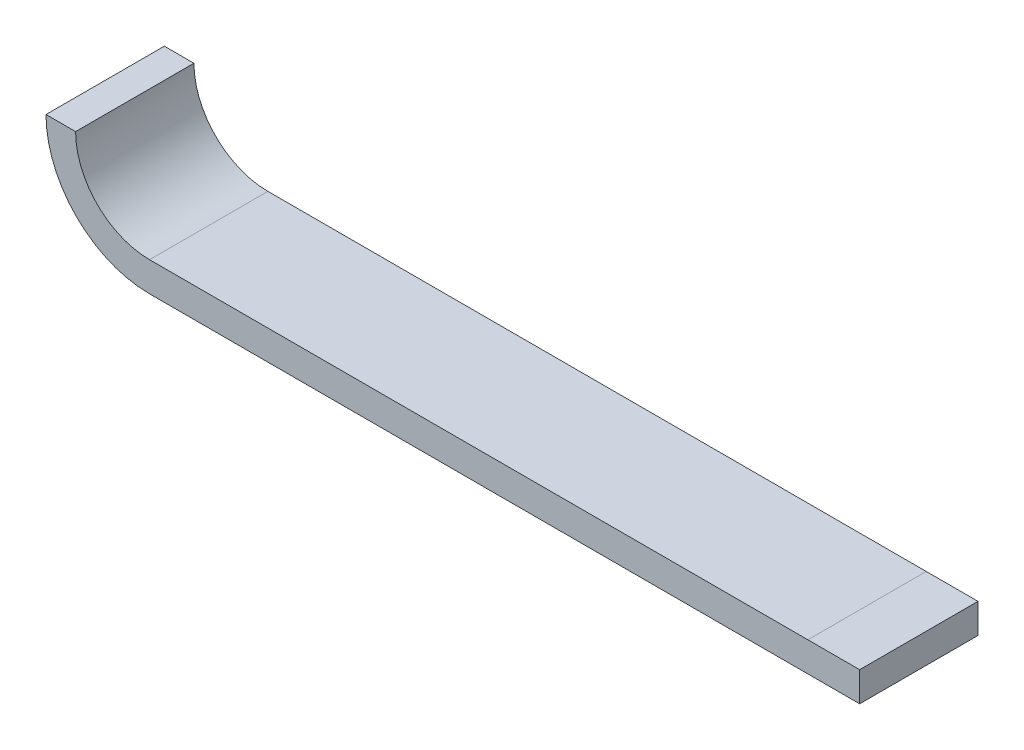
ISO-10303-21;
HEADER;
FILE_DESCRIPTION(('STEP AP214'),'2;1');
FILE_NAME('part.step','',(''),(''),'','','');
FILE_SCHEMA(('AUTOMOTIVE_DESIGN { 1 0 10303 214 1 1 1 1 }'));
ENDSEC;
DATA;
#1=APPLICATION_CONTEXT('core data for automotive mechanical design processes');
#2=APPLICATION_PROTOCOL_DEFINITION('international standard','automotive_design',2000,#1);
#3=PRODUCT_CONTEXT('',#1,'mechanical');
#4=PRODUCT('Part','Part','',(#3));
#5=PRODUCT_RELATED_PRODUCT_CATEGORY('part','',(#4));
#6=PRODUCT_DEFINITION_FORMATION('','',#4);
#7=PRODUCT_DEFINITION_CONTEXT('part definition',#1,'design');
#8=PRODUCT_DEFINITION('design','',#6,#7);
#9=PRODUCT_DEFINITION_SHAPE('','',#8);
#10=(LENGTH_UNIT() NAMED_UNIT(*) SI_UNIT(.MILLI.,.METRE.));
#11=(NAMED_UNIT(*) PLANE_ANGLE_UNIT() SI_UNIT($,.RADIAN.));
#12=(NAMED_UNIT(*) SI_UNIT($,.STERADIAN.) SOLID_ANGLE_UNIT());
#13=UNCERTAINTY_MEASURE_WITH_UNIT(LENGTH_MEASURE(1.E-05),#10,'distance_accuracy_value','');
#14=(GEOMETRIC_REPRESENTATION_CONTEXT(3) GLOBAL_UNCERTAINTY_ASSIGNED_CONTEXT((#13)) GLOBAL_UNIT_ASSIGNED_CONTEXT((#10,
#11,#12)) REPRESENTATION_CONTEXT('',''));
#15=CARTESIAN_POINT('',(0.,0.,0.));
#16=DIRECTION('',(0.,0.,1.));
#17=DIRECTION('',(1.,0.,0.));
#18=AXIS2_PLACEMENT_3D('',#15,#16,#17);
#19=CARTESIAN_POINT('',(0.,-31.75,25.4));
#20=DIRECTION('',(0.,1.,0.));
#21=DIRECTION('',(0.,0.,1.));
#22=AXIS2_PLACEMENT_3D('',#19,#20,#21);
#23=PLANE('',#22);
#24=DIRECTION('',(1.,0.,0.));
#25=VECTOR('',#24,1.);
#26=CARTESIAN_POINT('',(0.,-31.75,25.4));
#27=LINE('',#26,#25);
#28=CARTESIAN_POINT('',(0.,-31.75,25.4));
#29=VERTEX_POINT('',#28);
#30=CARTESIAN_POINT('',(282.575,-31.75,25.4));
#31=VERTEX_POINT('',#30);
#32=EDGE_CURVE('E134',#29,#31,#27,.T.);
#33=ORIENTED_EDGE('',*,*,#32,.T.);
#34=DIRECTION('',(0.,0.,-1.));
#35=VECTOR('',#34,1.);
#36=CARTESIAN_POINT('',(282.575,-31.75,25.4));
#37=LINE('',#36,#35);
#38=CARTESIAN_POINT('',(282.575,-31.75,-25.4));
#39=VERTEX_POINT('',#38);
#40=EDGE_CURVE('E11',#31,#39,#37,.T.);
#41=ORIENTED_EDGE('',*,*,#40,.T.);
#42=DIRECTION('',(1.,0.,0.));
#43=VECTOR('',#42,1.);
#44=CARTESIAN_POINT('',(0.,-31.75,-25.4));
#45=LINE('',#44,#43);
#46=CARTESIAN_POINT('',(0.,-31.75,-25.4));
#47=VERTEX_POINT('',#46);
#48=EDGE_CURVE('E162',#47,#39,#45,.T.);
#49=ORIENTED_EDGE('',*,*,#48,.F.);
#50=DIRECTION('',(0.,0.,1.));
#51=VECTOR('',#50,1.);
#52=CARTESIAN_POINT('',(0.,-31.75,25.4));
#53=LINE('',#52,#51);
#54=EDGE_CURVE('E120',#47,#29,#53,.T.);
#55=ORIENTED_EDGE('',*,*,#54,.T.);
#56=EDGE_LOOP('',(#33,#41,#49,#55));
#57=FACE_BOUND('',#56,.T.);
#58=ADVANCED_FACE('F36',(#57),#23,.T.);
#59=CARTESIAN_POINT('',(0.,-44.45,25.4));
#60=DIRECTION('',(0.,-1.,0.));
#61=DIRECTION('',(0.,0.,-1.));
#62=AXIS2_PLACEMENT_3D('',#59,#60,#61);
#63=PLANE('',#62);
#64=DIRECTION('',(1.,0.,0.));
#65=VECTOR('',#64,1.);
#66=CARTESIAN_POINT('',(0.,-44.45,-25.4));
#67=LINE('',#66,#65);
#68=CARTESIAN_POINT('',(0.,-44.45,-25.4));
#69=VERTEX_POINT('',#68);
#70=CARTESIAN_POINT('',(152.4,-44.45,-25.4));
#71=VERTEX_POINT('',#70);
#72=EDGE_CURVE('E128',#69,#71,#67,.T.);
#73=ORIENTED_EDGE('',*,*,#72,.T.);
#74=DIRECTION('',(0.,0.,1.));
#75=VECTOR('',#74,1.);
#76=CARTESIAN_POINT('',(152.4,-44.45,25.4));
#77=LINE('',#76,#75);
#78=CARTESIAN_POINT('',(152.4,-44.45,25.4));
#79=VERTEX_POINT('',#78);
#80=EDGE_CURVE('E45',#71,#79,#77,.T.);
#81=ORIENTED_EDGE('',*,*,#80,.T.);
#82=DIRECTION('',(1.,0.,0.));
#83=VECTOR('',#82,1.);
#84=CARTESIAN_POINT('',(0.,-44.45,25.4));
#85=LINE('',#84,#83);
#86=CARTESIAN_POINT('',(0.,-44.45,25.4));
#87=VERTEX_POINT('',#86);
#88=EDGE_CURVE('E104',#87,#79,#85,.T.);
#89=ORIENTED_EDGE('',*,*,#88,.F.);
#90=DIRECTION('',(0.,0.,-1.));
#91=VECTOR('',#90,1.);
#92=CARTESIAN_POINT('',(0.,-44.45,25.4));
#93=LINE('',#92,#91);
#94=EDGE_CURVE('E114',#87,#69,#93,.T.);
#95=ORIENTED_EDGE('',*,*,#94,.T.);
#96=EDGE_LOOP('',(#73,#81,#89,#95));
#97=FACE_BOUND('',#96,.T.);
#98=ADVANCED_FACE('F123',(#97),#63,.T.);
#99=CARTESIAN_POINT('',(0.,0.,0.));
#100=DIRECTION('',(0.,0.,-1.));
#101=DIRECTION('',(-1.,0.,0.));
#102=AXIS2_PLACEMENT_3D('',#99,#100,#101);
#103=CYLINDRICAL_SURFACE('',#102,31.75);
#104=ORIENTED_EDGE('',*,*,#54,.F.);
#105=CARTESIAN_POINT('',(0.,0.,-25.4));
#106=DIRECTION('',(0.,0.,-1.));
#107=DIRECTION('',(-1.,0.,0.));
#108=AXIS2_PLACEMENT_3D('',#105,#106,#107);
#109=CIRCLE('',#108,31.75);
#110=CARTESIAN_POINT('',(-31.75,0.,-25.4));
#111=VERTEX_POINT('',#110);
#112=EDGE_CURVE('E140',#47,#111,#109,.T.);
#113=ORIENTED_EDGE('',*,*,#112,.T.);
#114=DIRECTION('',(0.,0.,1.));
#115=VECTOR('',#114,1.);
#116=CARTESIAN_POINT('',(-31.75,0.,25.4));
#117=LINE('',#116,#115);
#118=CARTESIAN_POINT('',(-31.75,0.,25.4));
#119=VERTEX_POINT('',#118);
#120=EDGE_CURVE('E111',#111,#119,#117,.T.);
#121=ORIENTED_EDGE('',*,*,#120,.T.);
#122=CARTESIAN_POINT('',(0.,0.,25.4));
#123=DIRECTION('',(0.,0.,-1.));
#124=DIRECTION('',(-1.,0.,0.));
#125=AXIS2_PLACEMENT_3D('',#122,#123,#124);
#126=CIRCLE('',#125,31.75);
#127=EDGE_CURVE('E143',#29,#119,#126,.T.);
#128=ORIENTED_EDGE('',*,*,#127,.F.);
#129=EDGE_LOOP('',(#104,#113,#121,#128));
#130=FACE_BOUND('',#129,.T.);
#131=ADVANCED_FACE('F38',(#130),#103,.F.);
#132=CARTESIAN_POINT('',(0.,0.,0.));
#133=DIRECTION('',(0.,0.,-1.));
#134=DIRECTION('',(-1.,0.,0.));
#135=AXIS2_PLACEMENT_3D('',#132,#133,#134);
#136=CYLINDRICAL_SURFACE('',#135,44.45);
#137=ORIENTED_EDGE('',*,*,#94,.F.);
#138=CARTESIAN_POINT('',(0.,0.,25.4));
#139=DIRECTION('',(0.,0.,-1.));
#140=DIRECTION('',(-1.,0.,0.));
#141=AXIS2_PLACEMENT_3D('',#138,#139,#140);
#142=CIRCLE('',#141,44.45);
#143=CARTESIAN_POINT('',(-44.45,0.,25.4));
#144=VERTEX_POINT('',#143);
#145=EDGE_CURVE('E99',#87,#144,#142,.T.);
#146=ORIENTED_EDGE('',*,*,#145,.T.);
#147=DIRECTION('',(0.,0.,-1.));
#148=VECTOR('',#147,1.);
#149=CARTESIAN_POINT('',(-44.45,0.,25.4));
#150=LINE('',#149,#148);
#151=CARTESIAN_POINT('',(-44.45,0.,-25.4));
#152=VERTEX_POINT('',#151);
#153=EDGE_CURVE('E133',#144,#152,#150,.T.);
#154=ORIENTED_EDGE('',*,*,#153,.T.);
#155=CARTESIAN_POINT('',(0.,0.,-25.4));
#156=DIRECTION('',(0.,0.,-1.));
#157=DIRECTION('',(-1.,0.,0.));
#158=AXIS2_PLACEMENT_3D('',#155,#156,#157);
#159=CIRCLE('',#158,44.45);
#160=EDGE_CURVE('E110',#69,#152,#159,.T.);
#161=ORIENTED_EDGE('',*,*,#160,.F.);
#162=EDGE_LOOP('',(#137,#146,#154,#161));
#163=FACE_BOUND('',#162,.T.);
#164=ADVANCED_FACE('F115',(#163),#136,.T.);
#165=CARTESIAN_POINT('',(0.,-31.75,25.4));
#166=DIRECTION('',(0.,0.,1.));
#167=DIRECTION('',(1.,0.,0.));
#168=AXIS2_PLACEMENT_3D('',#165,#166,#167);
#169=PLANE('',#168);
#170=DIRECTION('',(0.,-1.,0.));
#171=VECTOR('',#170,1.);
#172=CARTESIAN_POINT('',(304.8,-31.75,25.4));
#173=LINE('',#172,#171);
#174=CARTESIAN_POINT('',(304.8,-31.75,25.4));
#175=VERTEX_POINT('',#174);
#176=CARTESIAN_POINT('',(304.8,-44.45,25.4));
#177=VERTEX_POINT('',#176);
#178=EDGE_CURVE('E175',#175,#177,#173,.T.);
#179=ORIENTED_EDGE('',*,*,#178,.F.);
#180=EDGE_CURVE('E165',#31,#175,#27,.T.);
#181=ORIENTED_EDGE('',*,*,#180,.F.);
#182=ORIENTED_EDGE('',*,*,#32,.F.);
#183=ORIENTED_EDGE('',*,*,#127,.T.);
#184=DIRECTION('',(-1.,0.,0.));
#185=VECTOR('',#184,1.);
#186=CARTESIAN_POINT('',(-31.75,0.,25.4));
#187=LINE('',#186,#185);
#188=EDGE_CURVE('E107',#119,#144,#187,.T.);
#189=ORIENTED_EDGE('',*,*,#188,.T.);
#190=ORIENTED_EDGE('',*,*,#145,.F.);
#191=ORIENTED_EDGE('',*,*,#88,.T.);
#192=EDGE_CURVE('E126',#79,#177,#85,.T.);
#193=ORIENTED_EDGE('',*,*,#192,.T.);
#194=EDGE_LOOP('',(#179,#181,#182,#183,#189,#190,#191,#193));
#195=FACE_BOUND('',#194,.T.);
#196=ADVANCED_FACE('F102',(#195),#169,.T.);
#197=ORIENTED_EDGE('',*,*,#40,.F.);
#198=ORIENTED_EDGE('',*,*,#180,.T.);
#199=DIRECTION('',(0.,0.,1.));
#200=VECTOR('',#199,1.);
#201=CARTESIAN_POINT('',(304.8,-31.75,25.4));
#202=LINE('',#201,#200);
#203=CARTESIAN_POINT('',(304.8,-31.75,-25.4));
#204=VERTEX_POINT('',#203);
#205=EDGE_CURVE('E121',#204,#175,#202,.T.);
#206=ORIENTED_EDGE('',*,*,#205,.F.);
#207=EDGE_CURVE('E161',#39,#204,#45,.T.);
#208=ORIENTED_EDGE('',*,*,#207,.F.);
#209=EDGE_LOOP('',(#197,#198,#206,#208));
#210=FACE_BOUND('',#209,.T.);
#211=ADVANCED_FACE('F180',(#210),#23,.T.);
#212=CARTESIAN_POINT('',(0.,-31.75,-25.4));
#213=DIRECTION('',(0.,0.,-1.));
#214=DIRECTION('',(0.,1.,0.));
#215=AXIS2_PLACEMENT_3D('',#212,#213,#214);
#216=PLANE('',#215);
#217=DIRECTION('',(0.,1.,0.));
#218=VECTOR('',#217,1.);
#219=CARTESIAN_POINT('',(304.8,-31.75,-25.4));
#220=LINE('',#219,#218);
#221=CARTESIAN_POINT('',(304.8,-44.45,-25.4));
#222=VERTEX_POINT('',#221);
#223=EDGE_CURVE('E170',#222,#204,#220,.T.);
#224=ORIENTED_EDGE('',*,*,#223,.F.);
#225=EDGE_CURVE('E125',#71,#222,#67,.T.);
#226=ORIENTED_EDGE('',*,*,#225,.F.);
#227=ORIENTED_EDGE('',*,*,#72,.F.);
#228=ORIENTED_EDGE('',*,*,#160,.T.);
#229=DIRECTION('',(1.,0.,0.));
#230=VECTOR('',#229,1.);
#231=CARTESIAN_POINT('',(-31.75,0.,-25.4));
#232=LINE('',#231,#230);
#233=EDGE_CURVE('E136',#152,#111,#232,.T.);
#234=ORIENTED_EDGE('',*,*,#233,.T.);
#235=ORIENTED_EDGE('',*,*,#112,.F.);
#236=ORIENTED_EDGE('',*,*,#48,.T.);
#237=ORIENTED_EDGE('',*,*,#207,.T.);
#238=EDGE_LOOP('',(#224,#226,#227,#228,#234,#235,#236,#237));
#239=FACE_BOUND('',#238,.T.);
#240=ADVANCED_FACE('F159',(#239),#216,.T.);
#241=ORIENTED_EDGE('',*,*,#80,.F.);
#242=ORIENTED_EDGE('',*,*,#225,.T.);
#243=DIRECTION('',(0.,0.,-1.));
#244=VECTOR('',#243,1.);
#245=CARTESIAN_POINT('',(304.8,-44.45,25.4));
#246=LINE('',#245,#244);
#247=EDGE_CURVE('E172',#177,#222,#246,.T.);
#248=ORIENTED_EDGE('',*,*,#247,.F.);
#249=ORIENTED_EDGE('',*,*,#192,.F.);
#250=EDGE_LOOP('',(#241,#242,#248,#249));
#251=FACE_BOUND('',#250,.T.);
#252=ADVANCED_FACE('F185',(#251),#63,.T.);
#253=CARTESIAN_POINT('',(-44.45,0.,25.4));
#254=DIRECTION('',(0.,-1.,0.));
#255=DIRECTION('',(0.,0.,-1.));
#256=AXIS2_PLACEMENT_3D('',#253,#254,#255);
#257=PLANE('',#256);
#258=ORIENTED_EDGE('',*,*,#188,.F.);
#259=ORIENTED_EDGE('',*,*,#120,.F.);
#260=ORIENTED_EDGE('',*,*,#233,.F.);
#261=ORIENTED_EDGE('',*,*,#153,.F.);
#262=EDGE_LOOP('',(#258,#259,#260,#261));
#263=FACE_BOUND('',#262,.T.);
#264=ADVANCED_FACE('F156',(#263),#257,.F.);
#265=CARTESIAN_POINT('',(304.8,-44.45,25.4));
#266=DIRECTION('',(1.,0.,0.));
#267=DIRECTION('',(0.,0.,-1.));
#268=AXIS2_PLACEMENT_3D('',#265,#266,#267);
#269=PLANE('',#268);
#270=ORIENTED_EDGE('',*,*,#178,.T.);
#271=ORIENTED_EDGE('',*,*,#247,.T.);
#272=ORIENTED_EDGE('',*,*,#223,.T.);
#273=ORIENTED_EDGE('',*,*,#205,.T.);
#274=EDGE_LOOP('',(#270,#271,#272,#273));
#275=FACE_BOUND('',#274,.T.);
#276=ADVANCED_FACE('F202',(#275),#269,.T.);
#277=CLOSED_SHELL('',(#58,#98,#131,#164,#196,#211,#240,#252,#264,#276));
#278=MANIFOLD_SOLID_BREP('B2',#277);
#279=ADVANCED_BREP_SHAPE_REPRESENTATION('',(#18,#278),#14);
#280=SHAPE_DEFINITION_REPRESENTATION(#9,#279);
ENDSEC;
END-ISO-10303-21;
